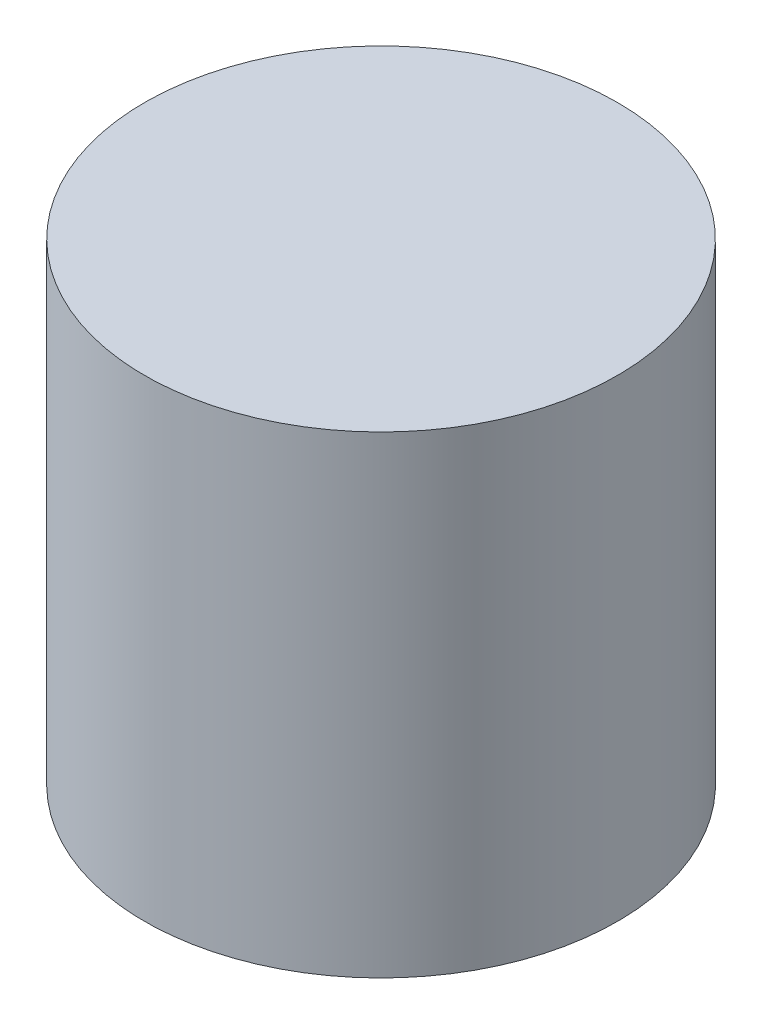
ISO-10303-21;
HEADER;
FILE_DESCRIPTION(('STEP AP214'),'2;1');
FILE_NAME('part.step','',(''),(''),'','','');
FILE_SCHEMA(('AUTOMOTIVE_DESIGN { 1 0 10303 214 1 1 1 1 }'));
ENDSEC;
DATA;
#1=APPLICATION_CONTEXT('core data for automotive mechanical design processes');
#2=APPLICATION_PROTOCOL_DEFINITION('international standard','automotive_design',2000,#1);
#3=PRODUCT_CONTEXT('',#1,'mechanical');
#4=PRODUCT('Part','Part','',(#3));
#5=PRODUCT_RELATED_PRODUCT_CATEGORY('part','',(#4));
#6=PRODUCT_DEFINITION_FORMATION('','',#4);
#7=PRODUCT_DEFINITION_CONTEXT('part definition',#1,'design');
#8=PRODUCT_DEFINITION('design','',#6,#7);
#9=PRODUCT_DEFINITION_SHAPE('','',#8);
#10=(LENGTH_UNIT() NAMED_UNIT(*) SI_UNIT(.MILLI.,.METRE.));
#11=(NAMED_UNIT(*) PLANE_ANGLE_UNIT() SI_UNIT($,.RADIAN.));
#12=(NAMED_UNIT(*) SI_UNIT($,.STERADIAN.) SOLID_ANGLE_UNIT());
#13=UNCERTAINTY_MEASURE_WITH_UNIT(LENGTH_MEASURE(1.E-05),#10,'distance_accuracy_value','');
#14=(GEOMETRIC_REPRESENTATION_CONTEXT(3) GLOBAL_UNCERTAINTY_ASSIGNED_CONTEXT((#13)) GLOBAL_UNIT_ASSIGNED_CONTEXT((#10,
#11,#12)) REPRESENTATION_CONTEXT('',''));
#15=CARTESIAN_POINT('',(0.,0.,0.));
#16=DIRECTION('',(0.,0.,1.));
#17=DIRECTION('',(1.,0.,0.));
#18=AXIS2_PLACEMENT_3D('',#15,#16,#17);
#19=CARTESIAN_POINT('',(0.,76.2,0.));
#20=DIRECTION('',(0.,-1.,0.));
#21=DIRECTION('',(0.,0.,-1.));
#22=AXIS2_PLACEMENT_3D('',#19,#20,#21);
#23=CYLINDRICAL_SURFACE('',#22,38.1);
#24=CARTESIAN_POINT('',(0.,76.2,0.));
#25=DIRECTION('',(0.,1.,0.));
#26=DIRECTION('',(0.,0.,1.));
#27=AXIS2_PLACEMENT_3D('',#24,#25,#26);
#28=CIRCLE('',#27,38.1);
#29=CARTESIAN_POINT('',(0.,76.2,-38.1));
#30=VERTEX_POINT('',#29);
#31=EDGE_CURVE('E11',#30,#30,#28,.T.);
#32=CARTESIAN_POINT('',(0.,0.,0.));
#33=DIRECTION('',(0.,1.,0.));
#34=DIRECTION('',(0.,0.,1.));
#35=AXIS2_PLACEMENT_3D('',#32,#33,#34);
#36=CIRCLE('',#35,38.1);
#37=CARTESIAN_POINT('',(0.,0.,-38.1));
#38=VERTEX_POINT('',#37);
#39=EDGE_CURVE('E39',#38,#38,#36,.T.);
#40=CARTESIAN_POINT('',(0.,76.2,-38.1));
#41=CARTESIAN_POINT('',(0.,75.40625,-38.1));
#42=CARTESIAN_POINT('',(0.,74.6125,-38.1));
#43=CARTESIAN_POINT('',(0.,73.025,-38.1));
#44=CARTESIAN_POINT('',(0.,72.23125,-38.1));
#45=CARTESIAN_POINT('',(0.,70.64375,-38.1));
#46=CARTESIAN_POINT('',(0.,69.85,-38.1));
#47=CARTESIAN_POINT('',(0.,68.2625,-38.1));
#48=CARTESIAN_POINT('',(0.,67.46875,-38.1));
#49=CARTESIAN_POINT('',(0.,65.88125,-38.1));
#50=CARTESIAN_POINT('',(0.,65.0875,-38.1));
#51=CARTESIAN_POINT('',(0.,63.5,-38.1));
#52=CARTESIAN_POINT('',(0.,62.70625,-38.1));
#53=CARTESIAN_POINT('',(0.,61.11875,-38.1));
#54=CARTESIAN_POINT('',(0.,60.325,-38.1));
#55=CARTESIAN_POINT('',(0.,58.7375,-38.1));
#56=CARTESIAN_POINT('',(0.,57.94375,-38.1));
#57=CARTESIAN_POINT('',(0.,56.35625,-38.1));
#58=CARTESIAN_POINT('',(0.,55.5625,-38.1));
#59=CARTESIAN_POINT('',(0.,53.975,-38.1));
#60=CARTESIAN_POINT('',(0.,53.18125,-38.1));
#61=CARTESIAN_POINT('',(0.,51.59375,-38.1));
#62=CARTESIAN_POINT('',(0.,50.8,-38.1));
#63=CARTESIAN_POINT('',(0.,49.2125,-38.1));
#64=CARTESIAN_POINT('',(0.,48.41875,-38.1));
#65=CARTESIAN_POINT('',(0.,46.83125,-38.1));
#66=CARTESIAN_POINT('',(0.,46.0375,-38.1));
#67=CARTESIAN_POINT('',(0.,44.45,-38.1));
#68=CARTESIAN_POINT('',(0.,43.65625,-38.1));
#69=CARTESIAN_POINT('',(0.,42.06875,-38.1));
#70=CARTESIAN_POINT('',(0.,41.275,-38.1));
#71=CARTESIAN_POINT('',(0.,39.6875,-38.1));
#72=CARTESIAN_POINT('',(0.,38.89375,-38.1));
#73=CARTESIAN_POINT('',(0.,37.30625,-38.1));
#74=CARTESIAN_POINT('',(0.,36.5125,-38.1));
#75=CARTESIAN_POINT('',(0.,34.925,-38.1));
#76=CARTESIAN_POINT('',(0.,34.13125,-38.1));
#77=CARTESIAN_POINT('',(0.,32.54375,-38.1));
#78=CARTESIAN_POINT('',(0.,31.75,-38.1));
#79=CARTESIAN_POINT('',(0.,30.1625,-38.1));
#80=CARTESIAN_POINT('',(0.,29.36875,-38.1));
#81=CARTESIAN_POINT('',(0.,27.78125,-38.1));
#82=CARTESIAN_POINT('',(0.,26.9875,-38.1));
#83=CARTESIAN_POINT('',(0.,25.4,-38.1));
#84=CARTESIAN_POINT('',(0.,24.60625,-38.1));
#85=CARTESIAN_POINT('',(0.,23.01875,-38.1));
#86=CARTESIAN_POINT('',(0.,22.225,-38.1));
#87=CARTESIAN_POINT('',(0.,20.6375,-38.1));
#88=CARTESIAN_POINT('',(0.,19.84375,-38.1));
#89=CARTESIAN_POINT('',(0.,18.25625,-38.1));
#90=CARTESIAN_POINT('',(0.,17.4625,-38.1));
#91=CARTESIAN_POINT('',(0.,15.875,-38.1));
#92=CARTESIAN_POINT('',(0.,15.08125,-38.1));
#93=CARTESIAN_POINT('',(0.,13.49375,-38.1));
#94=CARTESIAN_POINT('',(0.,12.7,-38.1));
#95=CARTESIAN_POINT('',(0.,11.1125,-38.1));
#96=CARTESIAN_POINT('',(0.,10.31875,-38.1));
#97=CARTESIAN_POINT('',(0.,8.73125,-38.1));
#98=CARTESIAN_POINT('',(0.,7.93750000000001,-38.1));
#99=CARTESIAN_POINT('',(0.,6.35,-38.1));
#100=CARTESIAN_POINT('',(0.,5.55625,-38.1));
#101=CARTESIAN_POINT('',(0.,3.96875,-38.1));
#102=CARTESIAN_POINT('',(0.,3.175,-38.1));
#103=CARTESIAN_POINT('',(0.,1.5875,-38.1));
#104=CARTESIAN_POINT('',(0.,0.793750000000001,-38.1));
#105=CARTESIAN_POINT('',(0.,0.,-38.1));
#106=B_SPLINE_CURVE_WITH_KNOTS('',3,(#40,#41,#42,#43,#44,#45,#46,#47,#48,#49,#50,#51,#52,#53,
#54,#55,#56,#57,#58,#59,#60,#61,#62,#63,#64,#65,#66,#67,#68,#69,#70,#71,#72,#73,#74,#75,#76,#77,
#78,#79,#80,#81,#82,#83,#84,#85,#86,#87,#88,#89,#90,#91,#92,#93,#94,#95,#96,#97,#98,#99,#100,
#101,#102,#103,#104,#105),.UNSPECIFIED.,.F.,.F.,(4,2,2,2,2,2,2,2,2,2,2,2,2,2,2,2,2,2,2,2,2,2,2,
2,2,2,2,2,2,2,2,2,4),(0.,2.38125,4.7625,7.14375,9.52500000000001,11.90625,14.2875,16.66875,
19.05,21.43125,23.8125,26.19375,28.575,30.95625,33.3375,35.71875,38.1,40.48125,42.8625,45.24375,
47.625,50.00625,52.3875,54.76875,57.15,59.53125,61.9125,64.29375,66.675,69.05625,71.4375,
73.81875,76.2),.UNSPECIFIED.);
#107=EDGE_CURVE('BSEAM36',#30,#38,#106,.T.);
#108=ORIENTED_EDGE('',*,*,#31,.F.);
#109=ORIENTED_EDGE('',*,*,#39,.T.);
#110=ORIENTED_EDGE('',*,*,#107,.T.);
#111=ORIENTED_EDGE('',*,*,#107,.F.);
#112=EDGE_LOOP('',(#108,#110,#109,#111));
#113=FACE_BOUND('',#112,.T.);
#114=ADVANCED_FACE('F36',(#113),#23,.T.);
#115=CARTESIAN_POINT('',(0.,76.2,0.));
#116=DIRECTION('',(0.,1.,0.));
#117=DIRECTION('',(0.,0.,1.));
#118=AXIS2_PLACEMENT_3D('',#115,#116,#117);
#119=PLANE('',#118);
#120=ORIENTED_EDGE('',*,*,#31,.T.);
#121=EDGE_LOOP('',(#120));
#122=FACE_BOUND('',#121,.T.);
#123=ADVANCED_FACE('F88',(#122),#119,.T.);
#124=CARTESIAN_POINT('',(0.,0.,0.));
#125=DIRECTION('',(0.,1.,0.));
#126=DIRECTION('',(0.,0.,1.));
#127=AXIS2_PLACEMENT_3D('',#124,#125,#126);
#128=PLANE('',#127);
#129=CARTESIAN_POINT('',(21.9970452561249,0.,-12.6999999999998));
#130=DIRECTION('',(0.,-1.,0.));
#131=DIRECTION('',(0.,0.,-1.));
#132=AXIS2_PLACEMENT_3D('',#129,#130,#131);
#133=CIRCLE('',#132,3.96874999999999);
#134=CARTESIAN_POINT('',(21.9970452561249,0.,-16.6687499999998));
#135=VERTEX_POINT('',#134);
#136=EDGE_CURVE('E64',#135,#135,#133,.T.);
#137=ORIENTED_EDGE('',*,*,#136,.F.);
#138=EDGE_LOOP('',(#137));
#139=FACE_BOUND('',#138,.T.);
#140=CARTESIAN_POINT('',(-21.9970452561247,0.,-12.7000000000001));
#141=DIRECTION('',(0.,-1.,0.));
#142=DIRECTION('',(0.,0.,-1.));
#143=AXIS2_PLACEMENT_3D('',#140,#141,#142);
#144=CIRCLE('',#143,3.96874999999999);
#145=CARTESIAN_POINT('',(-21.9970452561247,0.,-16.6687500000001));
#146=VERTEX_POINT('',#145);
#147=EDGE_CURVE('E63',#146,#146,#144,.T.);
#148=ORIENTED_EDGE('',*,*,#147,.F.);
#149=EDGE_LOOP('',(#148));
#150=FACE_BOUND('',#149,.T.);
#151=CARTESIAN_POINT('',(0.,0.,25.4));
#152=DIRECTION('',(0.,-1.,0.));
#153=DIRECTION('',(0.,0.,-1.));
#154=AXIS2_PLACEMENT_3D('',#151,#152,#153);
#155=CIRCLE('',#154,3.96874999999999);
#156=CARTESIAN_POINT('',(0.,0.,21.43125));
#157=VERTEX_POINT('',#156);
#158=EDGE_CURVE('E74',#157,#157,#155,.T.);
#159=ORIENTED_EDGE('',*,*,#158,.F.);
#160=EDGE_LOOP('',(#159));
#161=FACE_BOUND('',#160,.T.);
#162=ORIENTED_EDGE('',*,*,#39,.F.);
#163=EDGE_LOOP('',(#162));
#164=FACE_BOUND('',#163,.T.);
#165=ADVANCED_FACE('F85',(#139,#150,#161,#164),#128,.F.);
#166=CARTESIAN_POINT('',(0.,43.8125,25.4));
#167=DIRECTION('',(0.,-1.,0.));
#168=DIRECTION('',(0.,0.,-1.));
#169=AXIS2_PLACEMENT_3D('',#166,#167,#168);
#170=CONICAL_SURFACE('',#169,3.96874999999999,1.02974425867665);
#171=CARTESIAN_POINT('',(0.,46.1971655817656,25.4));
#172=VERTEX_POINT('',#171);
#173=VERTEX_LOOP('',#172);
#174=FACE_BOUND('',#173,.T.);
#175=CARTESIAN_POINT('',(0.,43.8125,25.4));
#176=DIRECTION('',(0.,-1.,0.));
#177=DIRECTION('',(0.,0.,-1.));
#178=AXIS2_PLACEMENT_3D('',#175,#176,#177);
#179=CIRCLE('',#178,3.96874999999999);
#180=CARTESIAN_POINT('',(0.,43.8125,21.43125));
#181=VERTEX_POINT('',#180);
#182=EDGE_CURVE('E77',#181,#181,#179,.T.);
#183=ORIENTED_EDGE('',*,*,#182,.T.);
#184=EDGE_LOOP('',(#183));
#185=FACE_BOUND('',#184,.T.);
#186=ADVANCED_FACE('F87',(#174,#185),#170,.F.);
#187=CARTESIAN_POINT('',(0.,0.,25.4));
#188=DIRECTION('',(0.,-1.,0.));
#189=DIRECTION('',(0.,0.,-1.));
#190=AXIS2_PLACEMENT_3D('',#187,#188,#189);
#191=CYLINDRICAL_SURFACE('',#190,3.96874999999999);
#192=ORIENTED_EDGE('',*,*,#182,.F.);
#193=EDGE_LOOP('',(#192));
#194=FACE_BOUND('',#193,.T.);
#195=ORIENTED_EDGE('',*,*,#158,.T.);
#196=EDGE_LOOP('',(#195));
#197=FACE_BOUND('',#196,.T.);
#198=ADVANCED_FACE('F94',(#194,#197),#191,.F.);
#199=CARTESIAN_POINT('',(-21.9970452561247,43.8125,-12.7000000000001));
#200=DIRECTION('',(0.,-1.,0.));
#201=DIRECTION('',(0.,0.,-1.));
#202=AXIS2_PLACEMENT_3D('',#199,#200,#201);
#203=CONICAL_SURFACE('',#202,3.96874999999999,1.02974425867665);
#204=CARTESIAN_POINT('',(-21.9970452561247,46.1971655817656,-12.7000000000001));
#205=VERTEX_POINT('',#204);
#206=VERTEX_LOOP('',#205);
#207=FACE_BOUND('',#206,.T.);
#208=CARTESIAN_POINT('',(-21.9970452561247,43.8125,-12.7000000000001));
#209=DIRECTION('',(0.,-1.,0.));
#210=DIRECTION('',(0.,0.,-1.));
#211=AXIS2_PLACEMENT_3D('',#208,#209,#210);
#212=CIRCLE('',#211,3.96874999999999);
#213=CARTESIAN_POINT('',(-21.9970452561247,43.8125,-16.6687500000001));
#214=VERTEX_POINT('',#213);
#215=EDGE_CURVE('E67',#214,#214,#212,.T.);
#216=ORIENTED_EDGE('',*,*,#215,.T.);
#217=EDGE_LOOP('',(#216));
#218=FACE_BOUND('',#217,.T.);
#219=ADVANCED_FACE('F125',(#207,#218),#203,.F.);
#220=CARTESIAN_POINT('',(-21.9970452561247,0.,-12.7000000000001));
#221=DIRECTION('',(0.,-1.,0.));
#222=DIRECTION('',(0.,0.,-1.));
#223=AXIS2_PLACEMENT_3D('',#220,#221,#222);
#224=CYLINDRICAL_SURFACE('',#223,3.96874999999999);
#225=ORIENTED_EDGE('',*,*,#215,.F.);
#226=EDGE_LOOP('',(#225));
#227=FACE_BOUND('',#226,.T.);
#228=ORIENTED_EDGE('',*,*,#147,.T.);
#229=EDGE_LOOP('',(#228));
#230=FACE_BOUND('',#229,.T.);
#231=ADVANCED_FACE('F57',(#227,#230),#224,.F.);
#232=CARTESIAN_POINT('',(21.9970452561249,43.8125,-12.6999999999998));
#233=DIRECTION('',(0.,-1.,0.));
#234=DIRECTION('',(0.,0.,-1.));
#235=AXIS2_PLACEMENT_3D('',#232,#233,#234);
#236=CONICAL_SURFACE('',#235,3.96874999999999,1.02974425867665);
#237=CARTESIAN_POINT('',(21.9970452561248,46.1971655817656,-12.6999999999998));
#238=VERTEX_POINT('',#237);
#239=VERTEX_LOOP('',#238);
#240=FACE_BOUND('',#239,.T.);
#241=CARTESIAN_POINT('',(21.9970452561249,43.8125,-12.6999999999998));
#242=DIRECTION('',(0.,-1.,0.));
#243=DIRECTION('',(0.,0.,-1.));
#244=AXIS2_PLACEMENT_3D('',#241,#242,#243);
#245=CIRCLE('',#244,3.96874999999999);
#246=CARTESIAN_POINT('',(21.9970452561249,43.8125,-16.6687499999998));
#247=VERTEX_POINT('',#246);
#248=EDGE_CURVE('E61',#247,#247,#245,.T.);
#249=ORIENTED_EDGE('',*,*,#248,.T.);
#250=EDGE_LOOP('',(#249));
#251=FACE_BOUND('',#250,.T.);
#252=ADVANCED_FACE('F53',(#240,#251),#236,.F.);
#253=CARTESIAN_POINT('',(21.9970452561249,0.,-12.6999999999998));
#254=DIRECTION('',(0.,-1.,0.));
#255=DIRECTION('',(0.,0.,-1.));
#256=AXIS2_PLACEMENT_3D('',#253,#254,#255);
#257=CYLINDRICAL_SURFACE('',#256,3.96874999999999);
#258=ORIENTED_EDGE('',*,*,#248,.F.);
#259=EDGE_LOOP('',(#258));
#260=FACE_BOUND('',#259,.T.);
#261=ORIENTED_EDGE('',*,*,#136,.T.);
#262=EDGE_LOOP('',(#261));
#263=FACE_BOUND('',#262,.T.);
#264=ADVANCED_FACE('F56',(#260,#263),#257,.F.);
#265=CLOSED_SHELL('',(#114,#123,#165,#186,#198,#219,#231,#252,#264));
#266=MANIFOLD_SOLID_BREP('B2',#265);
#267=ADVANCED_BREP_SHAPE_REPRESENTATION('',(#18,#266),#14);
#268=SHAPE_DEFINITION_REPRESENTATION(#9,#267);
ENDSEC;
END-ISO-10303-21;
